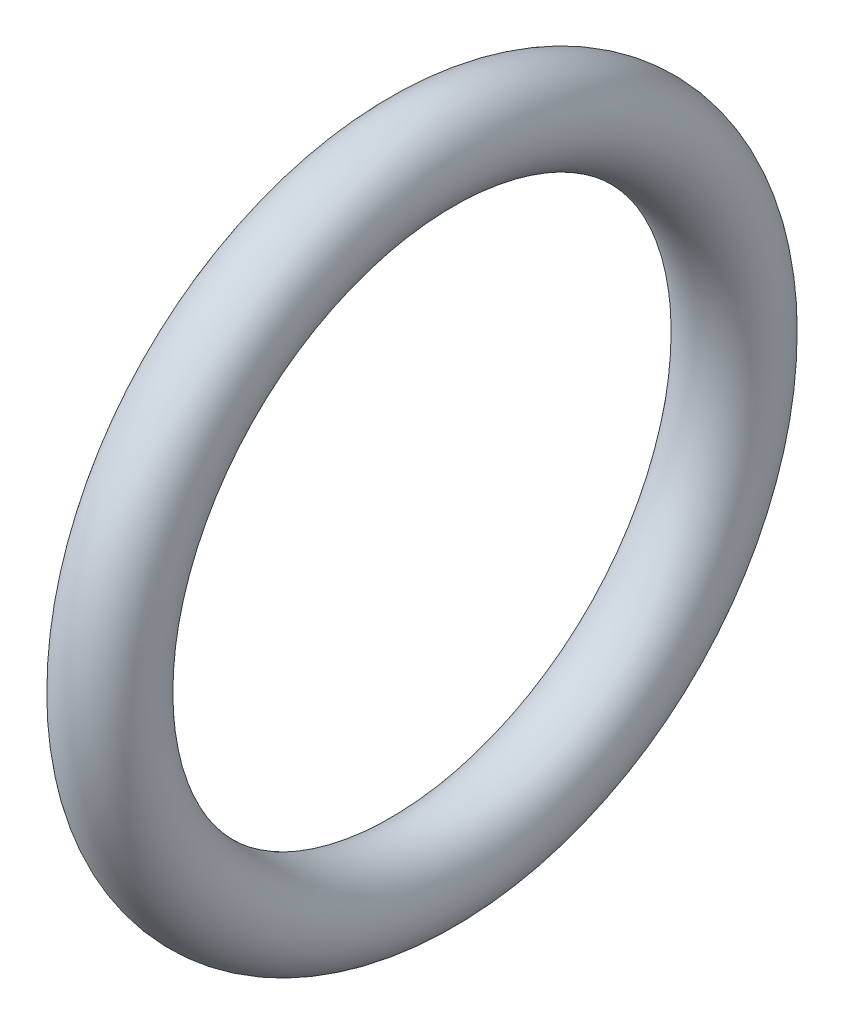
from build123d import *

# Parameters (mm, degrees)
ESQUISSE1_R = 1


with BuildPart() as part:
    # Esquisse1 → R_volution1 (revolve)
    with BuildSketch(Plane.XY, mode=Mode.PRIVATE) as r_volution1_sk:
        with Locations((0, 7)):
            Circle(ESQUISSE1_R)
    revolve(r_volution1_sk.sketch.rotate(Axis((-5.348863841, 0, 0), (1, 0, 0)), 90), axis=Axis((-5.348863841, 0, 0), (1, 0, 0)))


solid = part.part
